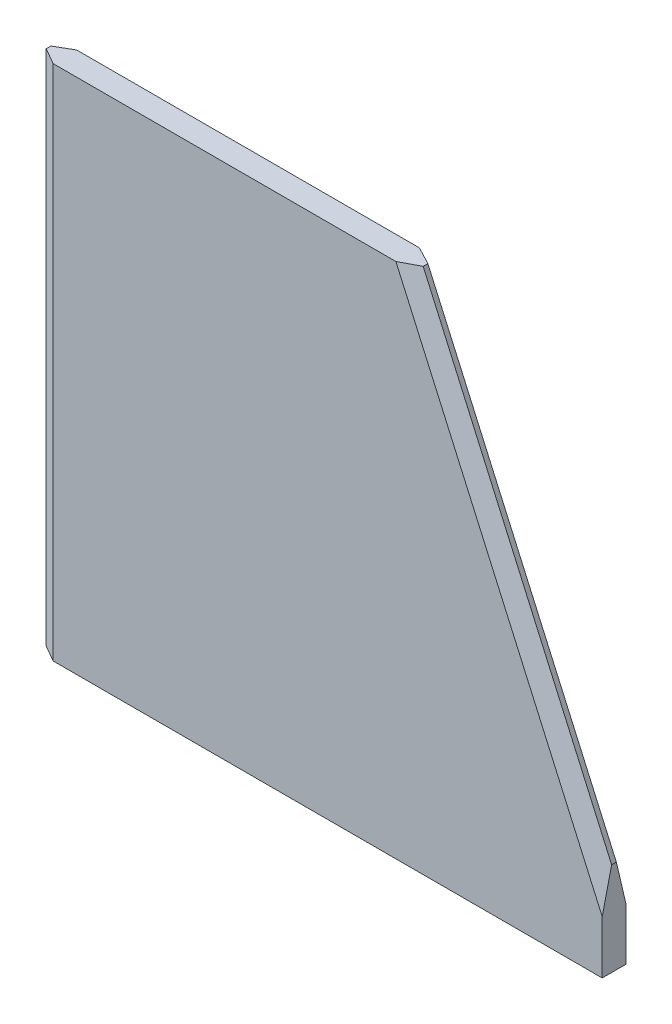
ISO-10303-21;
HEADER;
FILE_DESCRIPTION(('STEP AP214'),'2;1');
FILE_NAME('part.step','',(''),(''),'','','');
FILE_SCHEMA(('AUTOMOTIVE_DESIGN { 1 0 10303 214 1 1 1 1 }'));
ENDSEC;
DATA;
#1=APPLICATION_CONTEXT('core data for automotive mechanical design processes');
#2=APPLICATION_PROTOCOL_DEFINITION('international standard','automotive_design',2000,#1);
#3=PRODUCT_CONTEXT('',#1,'mechanical');
#4=PRODUCT('Part','Part','',(#3));
#5=PRODUCT_RELATED_PRODUCT_CATEGORY('part','',(#4));
#6=PRODUCT_DEFINITION_FORMATION('','',#4);
#7=PRODUCT_DEFINITION_CONTEXT('part definition',#1,'design');
#8=PRODUCT_DEFINITION('design','',#6,#7);
#9=PRODUCT_DEFINITION_SHAPE('','',#8);
#10=(LENGTH_UNIT() NAMED_UNIT(*) SI_UNIT(.MILLI.,.METRE.));
#11=(NAMED_UNIT(*) PLANE_ANGLE_UNIT() SI_UNIT($,.RADIAN.));
#12=(NAMED_UNIT(*) SI_UNIT($,.STERADIAN.) SOLID_ANGLE_UNIT());
#13=UNCERTAINTY_MEASURE_WITH_UNIT(LENGTH_MEASURE(1.E-05),#10,'distance_accuracy_value','');
#14=(GEOMETRIC_REPRESENTATION_CONTEXT(3) GLOBAL_UNCERTAINTY_ASSIGNED_CONTEXT((#13)) GLOBAL_UNIT_ASSIGNED_CONTEXT((#10,
#11,#12)) REPRESENTATION_CONTEXT('',''));
#15=CARTESIAN_POINT('',(0.,0.,0.));
#16=DIRECTION('',(0.,0.,1.));
#17=DIRECTION('',(1.,0.,0.));
#18=AXIS2_PLACEMENT_3D('',#15,#16,#17);
#19=CARTESIAN_POINT('',(0.,0.,3.175));
#20=DIRECTION('',(0.,1.,0.));
#21=DIRECTION('',(0.,0.,1.));
#22=AXIS2_PLACEMENT_3D('',#19,#20,#21);
#23=PLANE('',#22);
#24=DIRECTION('',(0.,0.,-1.));
#25=VECTOR('',#24,1.);
#26=CARTESIAN_POINT('',(0.,0.,3.175));
#27=LINE('',#26,#25);
#28=CARTESIAN_POINT('',(0.,0.,1.905));
#29=VERTEX_POINT('',#28);
#30=CARTESIAN_POINT('',(0.,0.,1.27));
#31=VERTEX_POINT('',#30);
#32=EDGE_CURVE('E126',#29,#31,#27,.T.);
#33=ORIENTED_EDGE('',*,*,#32,.T.);
#34=DIRECTION('',(-0.866025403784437,0.,0.500000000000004));
#35=VECTOR('',#34,1.);
#36=CARTESIAN_POINT('',(0.,0.,1.27));
#37=LINE('',#36,#35);
#38=CARTESIAN_POINT('',(2.19970452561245,0.,0.));
#39=VERTEX_POINT('',#38);
#40=EDGE_CURVE('E173',#31,#39,#37,.F.);
#41=ORIENTED_EDGE('',*,*,#40,.T.);
#42=DIRECTION('',(1.,0.,0.));
#43=VECTOR('',#42,1.);
#44=CARTESIAN_POINT('',(0.,0.,0.));
#45=LINE('',#44,#43);
#46=CARTESIAN_POINT('',(76.2,0.,0.));
#47=VERTEX_POINT('',#46);
#48=EDGE_CURVE('E122',#39,#47,#45,.T.);
#49=ORIENTED_EDGE('',*,*,#48,.T.);
#50=DIRECTION('',(0.,0.,-1.));
#51=VECTOR('',#50,1.);
#52=CARTESIAN_POINT('',(76.2,0.,3.175));
#53=LINE('',#52,#51);
#54=CARTESIAN_POINT('',(76.2,0.,3.175));
#55=VERTEX_POINT('',#54);
#56=EDGE_CURVE('E120',#55,#47,#53,.T.);
#57=ORIENTED_EDGE('',*,*,#56,.F.);
#58=DIRECTION('',(1.,0.,0.));
#59=VECTOR('',#58,1.);
#60=CARTESIAN_POINT('',(0.,0.,3.175));
#61=LINE('',#60,#59);
#62=CARTESIAN_POINT('',(2.19970452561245,0.,3.175));
#63=VERTEX_POINT('',#62);
#64=EDGE_CURVE('E108',#63,#55,#61,.T.);
#65=ORIENTED_EDGE('',*,*,#64,.F.);
#66=DIRECTION('',(-0.866025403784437,0.,-0.500000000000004));
#67=VECTOR('',#66,1.);
#68=CARTESIAN_POINT('',(2.19970452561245,0.,3.175));
#69=LINE('',#68,#67);
#70=EDGE_CURVE('E171',#63,#29,#69,.T.);
#71=ORIENTED_EDGE('',*,*,#70,.T.);
#72=EDGE_LOOP('',(#33,#41,#49,#57,#65,#71));
#73=FACE_BOUND('',#72,.T.);
#74=ADVANCED_FACE('F33',(#73),#23,.F.);
#75=CARTESIAN_POINT('',(76.2,0.,3.175));
#76=DIRECTION('',(-1.,0.,0.));
#77=DIRECTION('',(0.,-1.,0.));
#78=AXIS2_PLACEMENT_3D('',#75,#76,#77);
#79=PLANE('',#78);
#80=DIRECTION('',(0.,1.,0.));
#81=VECTOR('',#80,1.);
#82=CARTESIAN_POINT('',(76.2,0.,0.));
#83=LINE('',#82,#81);
#84=CARTESIAN_POINT('',(76.2,7.15685573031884,0.));
#85=VERTEX_POINT('',#84);
#86=EDGE_CURVE('E139',#47,#85,#83,.T.);
#87=ORIENTED_EDGE('',*,*,#86,.T.);
#88=DIRECTION('',(0.,-0.973592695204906,-0.228292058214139));
#89=VECTOR('',#88,1.);
#90=CARTESIAN_POINT('',(76.2000000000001,66.7444983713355,13.9723578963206));
#91=LINE('',#90,#89);
#92=CARTESIAN_POINT('',(76.2,12.573,1.27));
#93=VERTEX_POINT('',#92);
#94=EDGE_CURVE('E162',#85,#93,#91,.F.);
#95=ORIENTED_EDGE('',*,*,#94,.T.);
#96=DIRECTION('',(0.,0.,-1.));
#97=VECTOR('',#96,1.);
#98=CARTESIAN_POINT('',(76.2,12.573,3.175));
#99=LINE('',#98,#97);
#100=CARTESIAN_POINT('',(76.2,12.573,1.905));
#101=VERTEX_POINT('',#100);
#102=EDGE_CURVE('E127',#101,#93,#99,.T.);
#103=ORIENTED_EDGE('',*,*,#102,.F.);
#104=DIRECTION('',(0.,-0.973592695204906,0.228292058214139));
#105=VECTOR('',#104,1.);
#106=CARTESIAN_POINT('',(76.2,28.2984976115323,-1.78237998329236));
#107=LINE('',#106,#105);
#108=CARTESIAN_POINT('',(76.2,7.15685573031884,3.175));
#109=VERTEX_POINT('',#108);
#110=EDGE_CURVE('E132',#101,#109,#107,.T.);
#111=ORIENTED_EDGE('',*,*,#110,.T.);
#112=DIRECTION('',(0.,1.,0.));
#113=VECTOR('',#112,1.);
#114=CARTESIAN_POINT('',(76.2,0.,3.175));
#115=LINE('',#114,#113);
#116=EDGE_CURVE('E113',#55,#109,#115,.T.);
#117=ORIENTED_EDGE('',*,*,#116,.F.);
#118=ORIENTED_EDGE('',*,*,#56,.T.);
#119=EDGE_LOOP('',(#87,#95,#103,#111,#117,#118));
#120=FACE_BOUND('',#119,.T.);
#121=ADVANCED_FACE('F129',(#120),#79,.F.);
#122=CARTESIAN_POINT('',(50.8,69.723,3.175));
#123=DIRECTION('',(-0.913811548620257,-0.406138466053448,0.));
#124=DIRECTION('',(0.406138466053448,-0.913811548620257,0.));
#125=AXIS2_PLACEMENT_3D('',#122,#123,#124);
#126=PLANE('',#125);
#127=ORIENTED_EDGE('',*,*,#102,.T.);
#128=DIRECTION('',(-0.406138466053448,0.913811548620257,0.));
#129=VECTOR('',#128,1.);
#130=CARTESIAN_POINT('',(50.8,69.723,1.27));
#131=LINE('',#130,#129);
#132=CARTESIAN_POINT('',(50.8,69.723,1.27));
#133=VERTEX_POINT('',#132);
#134=EDGE_CURVE('E152',#93,#133,#131,.T.);
#135=ORIENTED_EDGE('',*,*,#134,.T.);
#136=DIRECTION('',(0.,0.,-1.));
#137=VECTOR('',#136,1.);
#138=CARTESIAN_POINT('',(50.8,69.723,3.175));
#139=LINE('',#138,#137);
#140=CARTESIAN_POINT('',(50.8,69.723,1.905));
#141=VERTEX_POINT('',#140);
#142=EDGE_CURVE('E144',#141,#133,#139,.T.);
#143=ORIENTED_EDGE('',*,*,#142,.F.);
#144=DIRECTION('',(0.406138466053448,-0.913811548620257,0.));
#145=VECTOR('',#144,1.);
#146=CARTESIAN_POINT('',(76.2,12.573,1.905));
#147=LINE('',#146,#145);
#148=EDGE_CURVE('E150',#141,#101,#147,.T.);
#149=ORIENTED_EDGE('',*,*,#148,.T.);
#150=EDGE_LOOP('',(#127,#135,#143,#149));
#151=FACE_BOUND('',#150,.T.);
#152=ADVANCED_FACE('F193',(#151),#126,.F.);
#153=CARTESIAN_POINT('',(0.,69.723,3.175));
#154=DIRECTION('',(0.,-1.,0.));
#155=DIRECTION('',(0.,0.,-1.));
#156=AXIS2_PLACEMENT_3D('',#153,#154,#155);
#157=PLANE('',#156);
#158=DIRECTION('',(-1.,0.,0.));
#159=VECTOR('',#158,1.);
#160=CARTESIAN_POINT('',(0.,69.723,0.));
#161=LINE('',#160,#159);
#162=CARTESIAN_POINT('',(48.3928247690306,69.723,0.));
#163=VERTEX_POINT('',#162);
#164=CARTESIAN_POINT('',(2.19970452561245,69.723,0.));
#165=VERTEX_POINT('',#164);
#166=EDGE_CURVE('E117',#163,#165,#161,.T.);
#167=ORIENTED_EDGE('',*,*,#166,.T.);
#168=DIRECTION('',(0.866025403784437,0.,-0.500000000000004));
#169=VECTOR('',#168,1.);
#170=CARTESIAN_POINT('',(0.,69.723,1.27));
#171=LINE('',#170,#169);
#172=CARTESIAN_POINT('',(0.,69.723,1.27));
#173=VERTEX_POINT('',#172);
#174=EDGE_CURVE('E41',#165,#173,#171,.F.);
#175=ORIENTED_EDGE('',*,*,#174,.T.);
#176=DIRECTION('',(0.,0.,-1.));
#177=VECTOR('',#176,1.);
#178=CARTESIAN_POINT('',(0.,69.723,3.175));
#179=LINE('',#178,#177);
#180=CARTESIAN_POINT('',(0.,69.723,1.905));
#181=VERTEX_POINT('',#180);
#182=EDGE_CURVE('E135',#181,#173,#179,.T.);
#183=ORIENTED_EDGE('',*,*,#182,.F.);
#184=DIRECTION('',(0.866025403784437,0.,0.500000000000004));
#185=VECTOR('',#184,1.);
#186=CARTESIAN_POINT('',(2.19970452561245,69.723,3.175));
#187=LINE('',#186,#185);
#188=CARTESIAN_POINT('',(2.19970452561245,69.723,3.175));
#189=VERTEX_POINT('',#188);
#190=EDGE_CURVE('E48',#181,#189,#187,.T.);
#191=ORIENTED_EDGE('',*,*,#190,.T.);
#192=DIRECTION('',(-1.,0.,0.));
#193=VECTOR('',#192,1.);
#194=CARTESIAN_POINT('',(0.,69.723,3.175));
#195=LINE('',#194,#193);
#196=CARTESIAN_POINT('',(48.3928247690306,69.723,3.175));
#197=VERTEX_POINT('',#196);
#198=EDGE_CURVE('E133',#197,#189,#195,.T.);
#199=ORIENTED_EDGE('',*,*,#198,.F.);
#200=DIRECTION('',(0.884453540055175,0.,-0.46662826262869));
#201=VECTOR('',#200,1.);
#202=CARTESIAN_POINT('',(62.3907506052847,69.723,-4.21015650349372));
#203=LINE('',#202,#201);
#204=EDGE_CURVE('E155',#197,#141,#203,.T.);
#205=ORIENTED_EDGE('',*,*,#204,.T.);
#206=ORIENTED_EDGE('',*,*,#142,.T.);
#207=DIRECTION('',(0.884453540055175,0.,0.46662826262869));
#208=VECTOR('',#207,1.);
#209=CARTESIAN_POINT('',(50.8,69.723,1.27));
#210=LINE('',#209,#208);
#211=EDGE_CURVE('E157',#133,#163,#210,.F.);
#212=ORIENTED_EDGE('',*,*,#211,.T.);
#213=EDGE_LOOP('',(#167,#175,#183,#191,#199,#205,#206,#212));
#214=FACE_BOUND('',#213,.T.);
#215=ADVANCED_FACE('F177',(#214),#157,.F.);
#216=CARTESIAN_POINT('',(0.,12.573,3.175));
#217=DIRECTION('',(1.,0.,0.));
#218=DIRECTION('',(0.,0.,-1.));
#219=AXIS2_PLACEMENT_3D('',#216,#217,#218);
#220=PLANE('',#219);
#221=ORIENTED_EDGE('',*,*,#182,.T.);
#222=DIRECTION('',(0.,-1.,0.));
#223=VECTOR('',#222,1.);
#224=CARTESIAN_POINT('',(0.,12.573,1.27));
#225=LINE('',#224,#223);
#226=EDGE_CURVE('E168',#173,#31,#225,.T.);
#227=ORIENTED_EDGE('',*,*,#226,.T.);
#228=ORIENTED_EDGE('',*,*,#32,.F.);
#229=DIRECTION('',(0.,1.,0.));
#230=VECTOR('',#229,1.);
#231=CARTESIAN_POINT('',(0.,69.723,1.905));
#232=LINE('',#231,#230);
#233=EDGE_CURVE('E166',#29,#181,#232,.T.);
#234=ORIENTED_EDGE('',*,*,#233,.T.);
#235=EDGE_LOOP('',(#221,#227,#228,#234));
#236=FACE_BOUND('',#235,.T.);
#237=ADVANCED_FACE('F181',(#236),#220,.F.);
#238=CARTESIAN_POINT('',(0.,0.,3.175));
#239=DIRECTION('',(0.,0.,1.));
#240=DIRECTION('',(1.,0.,0.));
#241=AXIS2_PLACEMENT_3D('',#238,#239,#240);
#242=PLANE('',#241);
#243=ORIENTED_EDGE('',*,*,#198,.T.);
#244=DIRECTION('',(0.,-1.,0.));
#245=VECTOR('',#244,1.);
#246=CARTESIAN_POINT('',(2.19970452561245,0.,3.175));
#247=LINE('',#246,#245);
#248=EDGE_CURVE('E11',#189,#63,#247,.T.);
#249=ORIENTED_EDGE('',*,*,#248,.T.);
#250=ORIENTED_EDGE('',*,*,#64,.T.);
#251=ORIENTED_EDGE('',*,*,#116,.T.);
#252=DIRECTION('',(-0.406138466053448,0.913811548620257,0.));
#253=VECTOR('',#252,1.);
#254=CARTESIAN_POINT('',(48.7898846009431,68.8296153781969,3.175));
#255=LINE('',#254,#253);
#256=EDGE_CURVE('E164',#109,#197,#255,.T.);
#257=ORIENTED_EDGE('',*,*,#256,.T.);
#258=EDGE_LOOP('',(#243,#249,#250,#251,#257));
#259=FACE_BOUND('',#258,.T.);
#260=ADVANCED_FACE('F110',(#259),#242,.T.);
#261=CARTESIAN_POINT('',(0.,0.,0.));
#262=DIRECTION('',(0.,0.,1.));
#263=DIRECTION('',(1.,0.,0.));
#264=AXIS2_PLACEMENT_3D('',#261,#262,#263);
#265=PLANE('',#264);
#266=ORIENTED_EDGE('',*,*,#48,.F.);
#267=DIRECTION('',(0.,1.,0.));
#268=VECTOR('',#267,1.);
#269=CARTESIAN_POINT('',(2.19970452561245,0.,0.));
#270=LINE('',#269,#268);
#271=EDGE_CURVE('E56',#39,#165,#270,.T.);
#272=ORIENTED_EDGE('',*,*,#271,.T.);
#273=ORIENTED_EDGE('',*,*,#166,.F.);
#274=DIRECTION('',(0.406138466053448,-0.913811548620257,0.));
#275=VECTOR('',#274,1.);
#276=CARTESIAN_POINT('',(66.2870804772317,29.4609246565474,0.));
#277=LINE('',#276,#275);
#278=EDGE_CURVE('E159',#163,#85,#277,.T.);
#279=ORIENTED_EDGE('',*,*,#278,.T.);
#280=ORIENTED_EDGE('',*,*,#86,.F.);
#281=EDGE_LOOP('',(#266,#272,#273,#279,#280));
#282=FACE_BOUND('',#281,.T.);
#283=ADVANCED_FACE('F185',(#282),#265,.F.);
#284=CARTESIAN_POINT('',(50.8,69.723,1.27));
#285=DIRECTION('',(-0.456905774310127,-0.203069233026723,0.86602540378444));
#286=DIRECTION('',(-0.406138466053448,0.913811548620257,0.));
#287=AXIS2_PLACEMENT_3D('',#284,#285,#286);
#288=PLANE('',#287);
#289=ORIENTED_EDGE('',*,*,#94,.F.);
#290=ORIENTED_EDGE('',*,*,#278,.F.);
#291=ORIENTED_EDGE('',*,*,#211,.F.);
#292=ORIENTED_EDGE('',*,*,#134,.F.);
#293=EDGE_LOOP('',(#289,#290,#291,#292));
#294=FACE_BOUND('',#293,.T.);
#295=ADVANCED_FACE('F190',(#294),#288,.F.);
#296=CARTESIAN_POINT('',(66.2870804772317,29.4609246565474,3.175));
#297=DIRECTION('',(0.456905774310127,0.203069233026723,0.86602540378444));
#298=DIRECTION('',(0.406138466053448,-0.913811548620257,0.));
#299=AXIS2_PLACEMENT_3D('',#296,#297,#298);
#300=PLANE('',#299);
#301=ORIENTED_EDGE('',*,*,#110,.F.);
#302=ORIENTED_EDGE('',*,*,#148,.F.);
#303=ORIENTED_EDGE('',*,*,#204,.F.);
#304=ORIENTED_EDGE('',*,*,#256,.F.);
#305=EDGE_LOOP('',(#301,#302,#303,#304));
#306=FACE_BOUND('',#305,.T.);
#307=ADVANCED_FACE('F196',(#306),#300,.T.);
#308=CARTESIAN_POINT('',(0.,12.573,1.27));
#309=DIRECTION('',(0.500000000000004,0.,0.866025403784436));
#310=DIRECTION('',(0.,-1.,0.));
#311=AXIS2_PLACEMENT_3D('',#308,#309,#310);
#312=PLANE('',#311);
#313=ORIENTED_EDGE('',*,*,#174,.F.);
#314=ORIENTED_EDGE('',*,*,#271,.F.);
#315=ORIENTED_EDGE('',*,*,#40,.F.);
#316=ORIENTED_EDGE('',*,*,#226,.F.);
#317=EDGE_LOOP('',(#313,#314,#315,#316));
#318=FACE_BOUND('',#317,.T.);
#319=ADVANCED_FACE('F184',(#318),#312,.F.);
#320=CARTESIAN_POINT('',(2.19970452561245,0.,3.175));
#321=DIRECTION('',(-0.500000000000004,0.,0.866025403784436));
#322=DIRECTION('',(0.,1.,0.));
#323=AXIS2_PLACEMENT_3D('',#320,#321,#322);
#324=PLANE('',#323);
#325=ORIENTED_EDGE('',*,*,#190,.F.);
#326=ORIENTED_EDGE('',*,*,#233,.F.);
#327=ORIENTED_EDGE('',*,*,#70,.F.);
#328=ORIENTED_EDGE('',*,*,#248,.F.);
#329=EDGE_LOOP('',(#325,#326,#327,#328));
#330=FACE_BOUND('',#329,.T.);
#331=ADVANCED_FACE('F35',(#330),#324,.T.);
#332=CLOSED_SHELL('',(#74,#121,#152,#215,#237,#260,#283,#295,#307,#319,#331));
#333=MANIFOLD_SOLID_BREP('B2',#332);
#334=ADVANCED_BREP_SHAPE_REPRESENTATION('',(#18,#333),#14);
#335=SHAPE_DEFINITION_REPRESENTATION(#9,#334);
ENDSEC;
END-ISO-10303-21;
